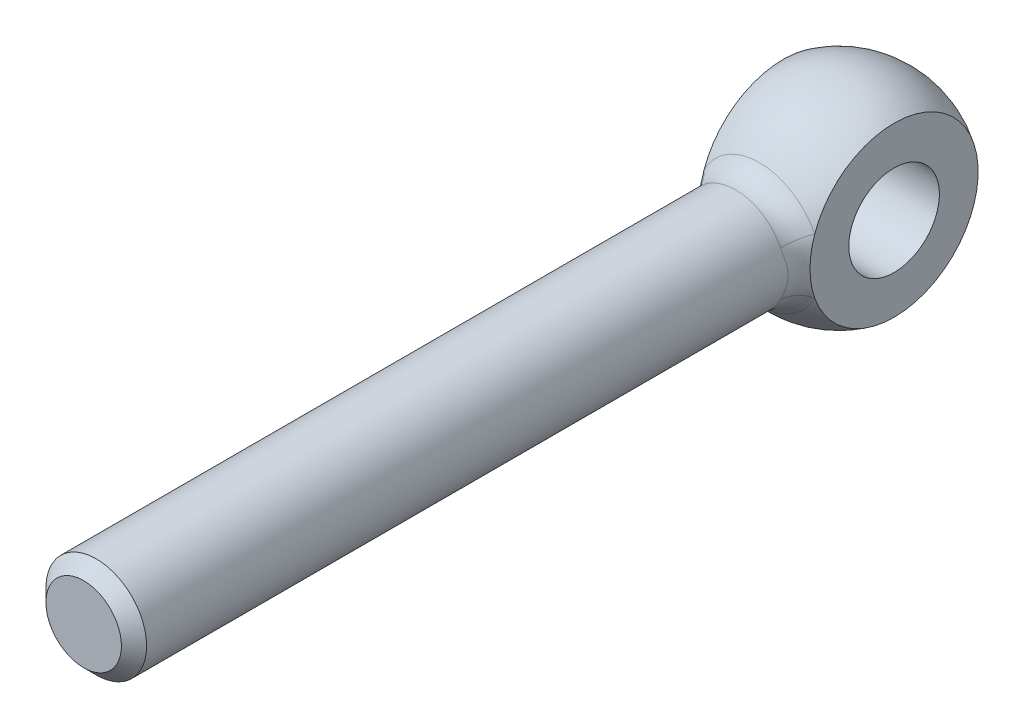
ISO-10303-21;
HEADER;
FILE_DESCRIPTION(('STEP AP214'),'2;1');
FILE_NAME('part.step','',(''),(''),'','','');
FILE_SCHEMA(('AUTOMOTIVE_DESIGN { 1 0 10303 214 1 1 1 1 }'));
ENDSEC;
DATA;
#1=APPLICATION_CONTEXT('core data for automotive mechanical design processes');
#2=APPLICATION_PROTOCOL_DEFINITION('international standard','automotive_design',2000,#1);
#3=PRODUCT_CONTEXT('',#1,'mechanical');
#4=PRODUCT('Part','Part','',(#3));
#5=PRODUCT_RELATED_PRODUCT_CATEGORY('part','',(#4));
#6=PRODUCT_DEFINITION_FORMATION('','',#4);
#7=PRODUCT_DEFINITION_CONTEXT('part definition',#1,'design');
#8=PRODUCT_DEFINITION('design','',#6,#7);
#9=PRODUCT_DEFINITION_SHAPE('','',#8);
#10=(LENGTH_UNIT() NAMED_UNIT(*) SI_UNIT(.MILLI.,.METRE.));
#11=(NAMED_UNIT(*) PLANE_ANGLE_UNIT() SI_UNIT($,.RADIAN.));
#12=(NAMED_UNIT(*) SI_UNIT($,.STERADIAN.) SOLID_ANGLE_UNIT());
#13=UNCERTAINTY_MEASURE_WITH_UNIT(LENGTH_MEASURE(1.E-05),#10,'distance_accuracy_value','');
#14=(GEOMETRIC_REPRESENTATION_CONTEXT(3) GLOBAL_UNCERTAINTY_ASSIGNED_CONTEXT((#13)) GLOBAL_UNIT_ASSIGNED_CONTEXT((#10,
#11,#12)) REPRESENTATION_CONTEXT('',''));
#15=CARTESIAN_POINT('',(0.,0.,0.));
#16=DIRECTION('',(0.,0.,1.));
#17=DIRECTION('',(1.,0.,0.));
#18=AXIS2_PLACEMENT_3D('',#15,#16,#17);
#19=CARTESIAN_POINT('',(0.,0.,0.));
#20=DIRECTION('',(-1.,0.,0.));
#21=DIRECTION('',(0.,0.,-1.));
#22=AXIS2_PLACEMENT_3D('',#19,#20,#21);
#23=SPHERICAL_SURFACE('',#22,20.);
#24=CARTESIAN_POINT('',(11.,0.,0.));
#25=DIRECTION('',(1.,0.,0.));
#26=DIRECTION('',(0.,0.,1.));
#27=AXIS2_PLACEMENT_3D('',#24,#25,#26);
#28=CIRCLE('',#27,16.70329308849);
#29=CARTESIAN_POINT('',(11.,5.52080518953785,15.7645396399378));
#30=VERTEX_POINT('',#29);
#31=CARTESIAN_POINT('',(11.,-5.52080518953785,15.7645396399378));
#32=VERTEX_POINT('',#31);
#33=EDGE_CURVE('E249',#30,#32,#28,.F.);
#34=ORIENTED_EDGE('',*,*,#33,.T.);
#35=CARTESIAN_POINT('',(0.,0.,15.7645396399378));
#36=DIRECTION('',(0.,0.,-1.));
#37=DIRECTION('',(-1.,0.,0.));
#38=AXIS2_PLACEMENT_3D('',#35,#36,#37);
#39=CIRCLE('',#38,12.3076923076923);
#40=CARTESIAN_POINT('',(-11.,-5.52080518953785,15.7645396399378));
#41=VERTEX_POINT('',#40);
#42=EDGE_CURVE('E72',#32,#41,#39,.T.);
#43=ORIENTED_EDGE('',*,*,#42,.T.);
#44=CARTESIAN_POINT('',(-11.,0.,0.));
#45=DIRECTION('',(1.,0.,0.));
#46=DIRECTION('',(0.,0.,1.));
#47=AXIS2_PLACEMENT_3D('',#44,#45,#46);
#48=CIRCLE('',#47,16.70329308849);
#49=CARTESIAN_POINT('',(-11.,5.52080518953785,15.7645396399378));
#50=VERTEX_POINT('',#49);
#51=EDGE_CURVE('E60',#50,#41,#48,.F.);
#52=ORIENTED_EDGE('',*,*,#51,.F.);
#53=CARTESIAN_POINT('',(0.,0.,15.7645396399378));
#54=DIRECTION('',(0.,0.,-1.));
#55=DIRECTION('',(-1.,0.,0.));
#56=AXIS2_PLACEMENT_3D('',#53,#54,#55);
#57=CIRCLE('',#56,12.3076923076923);
#58=EDGE_CURVE('E69',#50,#30,#57,.T.);
#59=ORIENTED_EDGE('',*,*,#58,.T.);
#60=EDGE_LOOP('',(#34,#43,#52,#59));
#61=FACE_BOUND('',#60,.T.);
#62=ADVANCED_FACE('F14',(#61),#23,.T.);
#63=CARTESIAN_POINT('',(0.,0.,-10.));
#64=DIRECTION('',(0.,0.,-1.));
#65=DIRECTION('',(1.,0.,0.));
#66=AXIS2_PLACEMENT_3D('',#63,#64,#65);
#67=CYLINDRICAL_SURFACE('',#66,10.);
#68=CARTESIAN_POINT('',(11.,8.07832617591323,14.6198716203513));
#69=CARTESIAN_POINT('',(8.08765754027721,5.99719772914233,16.1346741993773));
#70=CARTESIAN_POINT('',(7.28375150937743,6.85178545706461,19.8401938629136));
#71=CARTESIAN_POINT('',(11.,7.94371142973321,14.6942392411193));
#72=CARTESIAN_POINT('',(8.11920288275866,5.93544807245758,16.2397825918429));
#73=CARTESIAN_POINT('',(7.39683409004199,6.73162150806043,19.9238227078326));
#74=CARTESIAN_POINT('',(11.,7.80678494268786,14.7674864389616));
#75=CARTESIAN_POINT('',(8.15519367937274,5.8698319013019,16.3423149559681));
#76=CARTESIAN_POINT('',(7.50807818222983,6.60735770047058,19.9985173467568));
#77=CARTESIAN_POINT('',(11.,7.52777859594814,14.9116503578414));
#78=CARTESIAN_POINT('',(8.23492168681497,5.72986071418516,16.5404699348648));
#79=CARTESIAN_POINT('',(7.72578328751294,6.35140245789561,20.1309394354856));
#80=CARTESIAN_POINT('',(11.,7.38570047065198,14.9825678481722));
#81=CARTESIAN_POINT('',(8.27858235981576,5.65560014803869,16.6361171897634));
#82=CARTESIAN_POINT('',(7.83224588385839,6.21971351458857,20.1886725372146));
#83=CARTESIAN_POINT('',(11.,7.09641260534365,15.1217242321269));
#84=CARTESIAN_POINT('',(8.37244720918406,5.4973859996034,16.8193360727));
#85=CARTESIAN_POINT('',(8.03890108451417,5.95019585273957,20.2879075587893));
#86=CARTESIAN_POINT('',(11.,6.94922832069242,15.1899735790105));
#87=CARTESIAN_POINT('',(8.42255486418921,5.41357855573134,16.9069775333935));
#88=CARTESIAN_POINT('',(8.1391193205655,5.81239684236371,20.3294800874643));
#89=CARTESIAN_POINT('',(11.,6.64863682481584,15.3239259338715));
#90=CARTESIAN_POINT('',(8.52797993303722,5.23504745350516,17.0738797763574));
#91=CARTESIAN_POINT('',(8.33295854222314,5.53091179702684,20.3979224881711));
#92=CARTESIAN_POINT('',(11.,6.49523086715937,15.3896294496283));
#93=CARTESIAN_POINT('',(8.58324700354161,5.14042645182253,17.1531990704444));
#94=CARTESIAN_POINT('',(8.42658084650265,5.38722694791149,20.4247953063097));
#95=CARTESIAN_POINT('',(11.,6.20709411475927,15.5078088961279));
#96=CARTESIAN_POINT('',(8.68811994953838,4.95575537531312,17.2908288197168));
#97=CARTESIAN_POINT('',(8.59200338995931,5.11841729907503,20.4619167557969));
#98=CARTESIAN_POINT('',(11.,6.07336532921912,15.5607030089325));
#99=CARTESIAN_POINT('',(8.73711538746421,4.86761224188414,17.3504312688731));
#100=CARTESIAN_POINT('',(8.66488139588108,4.99405789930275,20.4741536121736));
#101=CARTESIAN_POINT('',(11.,5.80091130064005,15.6643118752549));
#102=CARTESIAN_POINT('',(8.83647568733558,4.68301353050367,17.4631108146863));
#103=CARTESIAN_POINT('',(8.80526889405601,4.74215537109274,20.4901477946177));
#104=CARTESIAN_POINT('',(11.,5.66218619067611,15.7150266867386));
#105=CARTESIAN_POINT('',(8.88683503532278,4.58660687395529,17.5162358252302));
#106=CARTESIAN_POINT('',(8.87277852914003,4.61461232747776,20.4939053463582));
#107=CARTESIAN_POINT('',(11.,5.2744874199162,15.8508024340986));
#108=CARTESIAN_POINT('',(9.02498244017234,4.31134076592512,17.6524759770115));
#109=CARTESIAN_POINT('',(9.05025948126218,4.26097993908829,20.4938948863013));
#110=CARTESIAN_POINT('',(11.,5.02010807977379,15.933417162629));
#111=CARTESIAN_POINT('',(9.1134168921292,4.12339116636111,17.7293699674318));
#112=CARTESIAN_POINT('',(9.15455589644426,4.03201043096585,20.482471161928));
#113=CARTESIAN_POINT('',(11.,4.49398867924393,16.0897301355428));
#114=CARTESIAN_POINT('',(9.2852606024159,3.7225223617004,17.8631716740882));
#115=CARTESIAN_POINT('',(9.3454636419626,3.56728408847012,20.4426249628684));
#116=CARTESIAN_POINT('',(11.,4.22223625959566,16.1634219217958));
#117=CARTESIAN_POINT('',(9.36879764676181,3.50966167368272,17.9203351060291));
#118=CARTESIAN_POINT('',(9.43206219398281,3.33152248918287,20.4141902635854));
#119=CARTESIAN_POINT('',(11.,3.65988605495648,16.2999751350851));
#120=CARTESIAN_POINT('',(9.52556401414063,3.06031940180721,18.0164117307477));
#121=CARTESIAN_POINT('',(9.58737307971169,2.8540318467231,20.3472388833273));
#122=CARTESIAN_POINT('',(11.,3.36923757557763,16.3628056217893));
#123=CARTESIAN_POINT('',(9.59896836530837,2.82367795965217,18.055508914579));
#124=CARTESIAN_POINT('',(9.65603459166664,2.61228792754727,20.3086941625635));
#125=CARTESIAN_POINT('',(11.,2.76973253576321,16.47487160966));
#126=CARTESIAN_POINT('',(9.7303273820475,2.33005694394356,18.1181298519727));
#127=CARTESIAN_POINT('',(9.77497001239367,2.12438390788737,20.2300406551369));
#128=CARTESIAN_POINT('',(11.,2.46087520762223,16.5241065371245));
#129=CARTESIAN_POINT('',(9.78851479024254,2.07279105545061,18.1418261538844));
#130=CARTESIAN_POINT('',(9.82524314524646,1.87822362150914,20.1899318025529));
#131=CARTESIAN_POINT('',(11.,1.97558099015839,16.5869215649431));
#132=CARTESIAN_POINT('',(9.8627242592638,1.66606653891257,18.1691299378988));
#133=CARTESIAN_POINT('',(9.88798469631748,1.49853407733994,20.1346921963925));
#134=CARTESIAN_POINT('',(11.,1.80486836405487,16.6064011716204));
#135=CARTESIAN_POINT('',(9.88572783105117,1.52271728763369,18.1769526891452));
#136=CARTESIAN_POINT('',(9.90713175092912,1.36624599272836,20.1166604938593));
#137=CARTESIAN_POINT('',(11.,1.45962748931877,16.6402989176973));
#138=CARTESIAN_POINT('',(9.92572316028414,1.2323607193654,18.1898667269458));
#139=CARTESIAN_POINT('',(9.94012224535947,1.1008390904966,20.0843097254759));
#140=CARTESIAN_POINT('',(11.,1.28509972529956,16.6547176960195));
#141=CARTESIAN_POINT('',(9.94274289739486,1.08526382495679,18.194968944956));
#142=CARTESIAN_POINT('',(9.95396635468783,0.967720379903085,20.0699901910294));
#143=CARTESIAN_POINT('',(11.,0.933265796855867,16.6781317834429));
#144=CARTESIAN_POINT('',(9.97034914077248,0.788518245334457,18.2029399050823));
#145=CARTESIAN_POINT('',(9.97630347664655,0.70091512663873,20.0463030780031));
#146=CARTESIAN_POINT('',(11.,0.755960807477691,16.6871293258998));
#147=CARTESIAN_POINT('',(9.98095837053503,0.638767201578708,18.2058159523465));
#148=CARTESIAN_POINT('',(9.98479869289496,0.567228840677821,20.0369334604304));
#149=CARTESIAN_POINT('',(11.,0.399779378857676,16.6994587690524));
#150=CARTESIAN_POINT('',(9.99548246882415,0.337908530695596,18.20969285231));
#151=CARTESIAN_POINT('',(9.99641148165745,0.299512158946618,20.024007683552));
#152=CARTESIAN_POINT('',(11.,0.220902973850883,16.7027907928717));
#153=CARTESIAN_POINT('',(9.99940850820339,0.186688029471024,18.2106967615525));
#154=CARTESIAN_POINT('',(9.99952917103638,0.165481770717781,20.0204513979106));
#155=CARTESIAN_POINT('',(11.,-0.136946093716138,16.7036898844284));
#156=CARTESIAN_POINT('',(10.0004672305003,-0.115727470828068,18.2109707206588));
#157=CARTESIAN_POINT('',(10.0003719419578,-0.102589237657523,20.0194964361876));
#158=CARTESIAN_POINT('',(11.,-0.315918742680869,16.7012576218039));
#159=CARTESIAN_POINT('',(9.99760151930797,-0.26703906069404,18.2102411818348));
#160=CARTESIAN_POINT('',(9.9980976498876,-0.236629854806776,20.0220970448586));
#161=CARTESIAN_POINT('',(11.,-0.672512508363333,16.6907025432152));
#162=CARTESIAN_POINT('',(9.98516890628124,-0.568286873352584,18.2069499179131));
#163=CARTESIAN_POINT('',(9.98816894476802,-0.504415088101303,20.0332017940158));
#164=CARTESIAN_POINT('',(11.,-0.850133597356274,16.6825796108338));
#165=CARTESIAN_POINT('',(9.97559239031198,-0.718336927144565,18.2043856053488));
#166=CARTESIAN_POINT('',(9.98051442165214,-0.638159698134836,20.0417060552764));
#167=CARTESIAN_POINT('',(11.,-1.20278271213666,16.6608685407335));
#168=CARTESIAN_POINT('',(9.94999783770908,-1.01586252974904,18.1971047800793));
#169=CARTESIAN_POINT('',(9.95985376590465,-0.905121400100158,20.063826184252));
#170=CARTESIAN_POINT('',(11.,-1.37780963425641,16.6472781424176));
#171=CARTESIAN_POINT('',(9.93395835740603,-1.16344227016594,18.1923815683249));
#172=CARTESIAN_POINT('',(9.94684541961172,-1.03833825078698,20.0774441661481));
#173=CARTESIAN_POINT('',(11.,-1.72418294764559,16.6149773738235));
#174=CARTESIAN_POINT('',(9.89585032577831,-1.45491369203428,18.1803094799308));
#175=CARTESIAN_POINT('',(9.91552061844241,-1.3039715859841,20.1086007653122));
#176=CARTESIAN_POINT('',(11.,-1.89552887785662,16.5962663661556));
#177=CARTESIAN_POINT('',(9.87375477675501,-1.59889725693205,18.1729504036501));
#178=CARTESIAN_POINT('',(9.89720350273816,-1.43638796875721,20.1261398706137));
#179=CARTESIAN_POINT('',(11.,-2.37500909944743,16.5365375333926));
#180=CARTESIAN_POINT('',(9.80319058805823,-2.00106700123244,18.1475319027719));
#181=CARTESIAN_POINT('',(9.83780774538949,-1.81042123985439,20.1794292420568));
#182=CARTESIAN_POINT('',(11.,-2.6779072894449,16.4899385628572));
#183=CARTESIAN_POINT('',(9.74810406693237,-2.25372442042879,18.1256509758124));
#184=CARTESIAN_POINT('',(9.79049373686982,-2.0509057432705,20.2181580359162));
#185=CARTESIAN_POINT('',(11.,-3.26643445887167,16.3835279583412));
#186=CARTESIAN_POINT('',(9.62321822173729,-2.7394442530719,18.0677502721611));
#187=CARTESIAN_POINT('',(9.67835774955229,-2.52772088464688,20.2950790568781));
#188=CARTESIAN_POINT('',(11.,-3.55206644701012,16.3237186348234));
#189=CARTESIAN_POINT('',(9.55320446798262,-2.97279590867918,18.0315791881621));
#190=CARTESIAN_POINT('',(9.61353883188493,-2.7640522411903,20.333271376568));
#191=CARTESIAN_POINT('',(11.,-4.10520079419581,16.1934500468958));
#192=CARTESIAN_POINT('',(9.40307308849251,-3.41694854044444,17.9425152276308));
#193=CARTESIAN_POINT('',(9.46676566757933,-3.23111087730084,20.4009956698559));
#194=CARTESIAN_POINT('',(11.,-4.37275328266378,16.1230221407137));
#195=CARTESIAN_POINT('',(9.32279049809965,-3.6279239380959,17.8894603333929));
#196=CARTESIAN_POINT('',(9.38486161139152,-3.4618524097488,20.430552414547));
#197=CARTESIAN_POINT('',(11.,-4.89128593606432,15.9733573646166));
#198=CARTESIAN_POINT('',(9.15681833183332,-4.02651224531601,17.7649594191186));
#199=CARTESIAN_POINT('',(9.20410009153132,-3.91720598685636,20.4744658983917));
#200=CARTESIAN_POINT('',(11.,-5.14226890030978,15.8941219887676));
#201=CARTESIAN_POINT('',(9.07099592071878,-4.21407941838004,17.6932699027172));
#202=CARTESIAN_POINT('',(9.10524550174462,-4.14181906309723,20.4888252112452));
#203=CARTESIAN_POINT('',(11.,-5.57948076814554,15.7452016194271));
#204=CARTESIAN_POINT('',(8.91675575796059,-4.52930004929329,17.5476124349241));
#205=CARTESIAN_POINT('',(8.91288683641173,-4.53858237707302,20.4959451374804));
#206=CARTESIAN_POINT('',(11.,-5.76853191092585,15.6768309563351));
#207=CARTESIAN_POINT('',(8.84816828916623,-4.66157604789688,17.4767712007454));
#208=CARTESIAN_POINT('',(8.82235160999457,-4.71214727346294,20.4924900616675));
#209=CARTESIAN_POINT('',(11.,-6.13738931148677,15.5361317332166));
#210=CARTESIAN_POINT('',(8.71360068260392,-4.91098552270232,17.3233243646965));
#211=CARTESIAN_POINT('',(8.63145758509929,-5.05332990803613,20.4699143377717));
#212=CARTESIAN_POINT('',(11.,-6.31719880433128,15.4638045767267));
#213=CARTESIAN_POINT('',(8.64763428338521,-5.02800230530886,17.2406040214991));
#214=CARTESIAN_POINT('',(8.53110226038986,-5.2209497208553,20.4507992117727));
#215=CARTESIAN_POINT('',(11.,-6.67039350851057,15.3147992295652));
#216=CARTESIAN_POINT('',(8.52017906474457,-5.24885941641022,17.062956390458));
#217=CARTESIAN_POINT('',(8.32005997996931,-5.55115938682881,20.3943977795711));
#218=CARTESIAN_POINT('',(11.,-6.84367796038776,15.2380797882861));
#219=CARTESIAN_POINT('',(8.45881409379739,-5.35236860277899,16.967804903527));
#220=CARTESIAN_POINT('',(8.20926514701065,-5.71366661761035,20.3568998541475));
#221=CARTESIAN_POINT('',(11.,-7.18254092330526,15.0813064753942));
#222=CARTESIAN_POINT('',(8.34361214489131,-5.54600465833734,16.7669351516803));
#223=CARTESIAN_POINT('',(7.97938823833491,-6.03058739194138,20.2617246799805));
#224=CARTESIAN_POINT('',(11.,-7.34810983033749,15.0012486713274));
#225=CARTESIAN_POINT('',(8.28987110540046,-5.63596246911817,16.6611306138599));
#226=CARTESIAN_POINT('',(7.86029627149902,-6.18499087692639,20.2040230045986));
#227=CARTESIAN_POINT('',(11.,-7.51010721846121,14.919728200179));
#228=CARTESIAN_POINT('',(8.24137694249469,-5.71943183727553,16.5511784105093));
#229=CARTESIAN_POINT('',(7.73770382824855,-6.3346617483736,20.1353038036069));
#230=(BOUNDED_SURFACE() B_SPLINE_SURFACE(3,2,((#68,#69,#70),(#71,#72,#73),(#74,#75,#76),(#77,
#78,#79),(#80,#81,#82),(#83,#84,#85),(#86,#87,#88),(#89,#90,#91),(#92,#93,#94),(#95,#96,#97),
(#98,#99,#100),(#101,#102,#103),(#104,#105,#106),(#107,#108,#109),(#110,#111,#112),(#113,#114,
#115),(#116,#117,#118),(#119,#120,#121),(#122,#123,#124),(#125,#126,#127),(#128,#129,#130),
(#131,#132,#133),(#134,#135,#136),(#137,#138,#139),(#140,#141,#142),(#143,#144,#145),(#146,#147,
#148),(#149,#150,#151),(#152,#153,#154),(#155,#156,#157),(#158,#159,#160),(#161,#162,#163),
(#164,#165,#166),(#167,#168,#169),(#170,#171,#172),(#173,#174,#175),(#176,#177,#178),(#179,#180,
#181),(#182,#183,#184),(#185,#186,#187),(#188,#189,#190),(#191,#192,#193),(#194,#195,#196),
(#197,#198,#199),(#200,#201,#202),(#203,#204,#205),(#206,#207,#208),(#209,#210,#211),(#212,#213,
#214),(#215,#216,#217),(#218,#219,#220),(#221,#222,#223),(#224,#225,#226),(#227,#228,#229)),
.UNSPECIFIED.,.F.,.F.,.F.) B_SPLINE_SURFACE_WITH_KNOTS((4,2,2,2,2,2,2,2,2,2,2,2,2,2,2,2,2,2,2,2,
2,2,2,2,2,2,4),(3,3),(0.,0.830487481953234,1.66069791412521,2.48723908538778,3.31361454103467,
4.00607990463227,4.69852683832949,5.90492644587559,7.11219405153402,8.32284604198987,
9.53354911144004,10.1772580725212,10.8208857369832,11.4642480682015,12.1075964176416,
12.7508700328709,13.3941568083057,14.0377098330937,14.6813430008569,15.8623569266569,
17.043164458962,18.2205508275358,19.3977377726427,20.336589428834,21.2751101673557,
22.224698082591,23.1754380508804),(0.,1.),
.UNSPECIFIED.) GEOMETRIC_REPRESENTATION_ITEM() RATIONAL_B_SPLINE_SURFACE(((1.,0.839284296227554,
1.),(1.,0.842507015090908,1.),(1.,0.845813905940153,1.),(1.,0.852563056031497,1.),(1.,
0.85600526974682,1.),(1.,0.862978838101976,1.),(1.,0.86650973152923,1.),(1.,0.873627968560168,
1.),(1.,0.877215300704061,1.),(1.,0.883811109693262,1.),(1.,0.886819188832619,1.),(1.,
0.892802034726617,1.),(1.,0.895776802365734,1.),(1.,0.903839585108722,1.),(1.,0.908857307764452,
1.),(1.,0.918479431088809,1.),(1.,0.923083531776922,1.),(1.,0.931678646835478,1.),(1.,
0.935667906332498,1.),(1.,0.942805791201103,1.),(1.,0.94595438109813,1.),(1.,0.949974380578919,
1.),(1.,0.95122168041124,1.),(1.,0.953392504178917,1.),(1.,0.954316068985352,1.),(1.,
0.955815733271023,1.),(1.,0.956391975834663,1.),(1.,0.957181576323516,1.),(1.,0.957394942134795,
1.),(1.,0.957452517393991,1.),(1.,0.957296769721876,1.),(1.,0.956620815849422,1.),(1.,
0.95610060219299,1.),(1.,0.954710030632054,1.),(1.,0.953839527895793,1.),(1.,0.951770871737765,
1.),(1.,0.950572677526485,1.),(1.,0.946749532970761,1.),(1.,0.943768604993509,1.),(1.,
0.936985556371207,1.),(1.,0.933183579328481,1.),(1.,0.924966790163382,1.),(1.,0.920553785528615,
1.),(1.,0.911300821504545,1.),(1.,0.906460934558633,1.),(1.,0.897549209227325,1.),(1.,
0.893520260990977,1.),(1.,0.885405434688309,1.),(1.,0.881319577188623,1.),(1.,0.873128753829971,
1.),(1.,0.869024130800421,1.),(1.,0.860913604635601,1.),(1.,0.856907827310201,1.),(1.,
0.852991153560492,1.))) REPRESENTATION_ITEM('') SURFACE());
#231=CARTESIAN_POINT('',(7.73770382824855,-6.3346617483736,20.1353038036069));
#232=CARTESIAN_POINT('',(7.86029627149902,-6.18499087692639,20.2040230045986));
#233=CARTESIAN_POINT('',(7.97938823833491,-6.03058739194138,20.2617246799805));
#234=CARTESIAN_POINT('',(8.20926514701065,-5.71366661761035,20.3568998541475));
#235=CARTESIAN_POINT('',(8.32005997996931,-5.55115938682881,20.3943977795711));
#236=CARTESIAN_POINT('',(8.53110226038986,-5.2209497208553,20.4507992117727));
#237=CARTESIAN_POINT('',(8.63145758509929,-5.05332990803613,20.4699143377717));
#238=CARTESIAN_POINT('',(8.82235160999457,-4.71214727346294,20.4924900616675));
#239=CARTESIAN_POINT('',(8.91288683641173,-4.53858237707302,20.4959451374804));
#240=CARTESIAN_POINT('',(9.10524550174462,-4.14181906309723,20.4888252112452));
#241=CARTESIAN_POINT('',(9.20410009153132,-3.91720598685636,20.4744658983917));
#242=CARTESIAN_POINT('',(9.38486161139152,-3.4618524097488,20.430552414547));
#243=CARTESIAN_POINT('',(9.46676566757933,-3.23111087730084,20.4009956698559));
#244=CARTESIAN_POINT('',(9.61353883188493,-2.7640522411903,20.333271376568));
#245=CARTESIAN_POINT('',(9.67835774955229,-2.52772088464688,20.2950790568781));
#246=CARTESIAN_POINT('',(9.79049373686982,-2.0509057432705,20.2181580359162));
#247=CARTESIAN_POINT('',(9.83780774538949,-1.81042123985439,20.1794292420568));
#248=CARTESIAN_POINT('',(9.89720350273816,-1.43638796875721,20.1261398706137));
#249=CARTESIAN_POINT('',(9.91552061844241,-1.3039715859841,20.1086007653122));
#250=CARTESIAN_POINT('',(9.94684541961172,-1.03833825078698,20.0774441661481));
#251=CARTESIAN_POINT('',(9.95985376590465,-0.905121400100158,20.063826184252));
#252=CARTESIAN_POINT('',(9.98051442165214,-0.638159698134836,20.0417060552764));
#253=CARTESIAN_POINT('',(9.98816894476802,-0.504415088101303,20.0332017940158));
#254=CARTESIAN_POINT('',(9.9980976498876,-0.236629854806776,20.0220970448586));
#255=CARTESIAN_POINT('',(10.0003719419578,-0.102589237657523,20.0194964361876));
#256=CARTESIAN_POINT('',(9.99952917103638,0.165481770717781,20.0204513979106));
#257=CARTESIAN_POINT('',(9.99641148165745,0.299512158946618,20.024007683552));
#258=CARTESIAN_POINT('',(9.98479869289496,0.567228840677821,20.0369334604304));
#259=CARTESIAN_POINT('',(9.97630347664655,0.70091512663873,20.0463030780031));
#260=CARTESIAN_POINT('',(9.95396635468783,0.967720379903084,20.0699901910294));
#261=CARTESIAN_POINT('',(9.94012224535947,1.1008390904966,20.0843097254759));
#262=CARTESIAN_POINT('',(9.90713175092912,1.36624599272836,20.1166604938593));
#263=CARTESIAN_POINT('',(9.88798469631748,1.49853407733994,20.1346921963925));
#264=CARTESIAN_POINT('',(9.82524314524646,1.87822362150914,20.1899318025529));
#265=CARTESIAN_POINT('',(9.77497001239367,2.12438390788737,20.2300406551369));
#266=CARTESIAN_POINT('',(9.65603459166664,2.61228792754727,20.3086941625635));
#267=CARTESIAN_POINT('',(9.58737307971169,2.8540318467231,20.3472388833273));
#268=CARTESIAN_POINT('',(9.43206219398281,3.33152248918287,20.4141902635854));
#269=CARTESIAN_POINT('',(9.3454636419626,3.56728408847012,20.4426249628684));
#270=CARTESIAN_POINT('',(9.15455589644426,4.03201043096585,20.482471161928));
#271=CARTESIAN_POINT('',(9.05025948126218,4.26097993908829,20.4938948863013));
#272=CARTESIAN_POINT('',(8.87277852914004,4.61461232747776,20.4939053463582));
#273=CARTESIAN_POINT('',(8.80526889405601,4.74215537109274,20.4901477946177));
#274=CARTESIAN_POINT('',(8.66488139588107,4.99405789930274,20.4741536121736));
#275=CARTESIAN_POINT('',(8.59200338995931,5.11841729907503,20.4619167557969));
#276=CARTESIAN_POINT('',(8.42658084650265,5.38722694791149,20.4247953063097));
#277=CARTESIAN_POINT('',(8.33295854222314,5.53091179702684,20.3979224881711));
#278=CARTESIAN_POINT('',(8.1391193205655,5.81239684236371,20.3294800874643));
#279=CARTESIAN_POINT('',(8.03890108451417,5.95019585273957,20.2879075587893));
#280=CARTESIAN_POINT('',(7.83224588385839,6.21971351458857,20.1886725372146));
#281=CARTESIAN_POINT('',(7.72578328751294,6.35140245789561,20.1309394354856));
#282=CARTESIAN_POINT('',(7.50807818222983,6.60735770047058,19.9985173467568));
#283=CARTESIAN_POINT('',(7.39683409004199,6.73162150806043,19.9238227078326));
#284=CARTESIAN_POINT('',(7.28375150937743,6.85178545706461,19.8401938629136));
#285=B_SPLINE_CURVE_WITH_KNOTS('',3,(#231,#232,#233,#234,#235,#236,#237,#238,#239,#240,#241,
#242,#243,#244,#245,#246,#247,#248,#249,#250,#251,#252,#253,#254,#255,#256,#257,#258,#259,#260,
#261,#262,#263,#264,#265,#266,#267,#268,#269,#270,#271,#272,#273,#274,#275,#276,#277,#278,#279,
#280,#281,#282,#283,#284),.UNSPECIFIED.,.F.,.F.,(4,2,2,2,2,2,2,2,2,2,2,2,2,2,2,2,2,2,2,2,2,2,2,
2,2,2,4),(0.,0.950739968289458,1.90032788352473,2.8388486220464,3.77770027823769,
4.95488722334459,6.13227359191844,7.31308112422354,8.49409505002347,9.13772821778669,
9.7812812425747,10.4245680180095,11.0678416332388,11.711189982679,12.3545523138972,
12.9981799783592,13.6418889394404,14.8525920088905,16.0632439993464,17.2705116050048,
18.4769112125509,19.1693581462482,19.8618235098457,20.6881989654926,21.5147401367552,
22.3449505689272,23.1754380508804),.UNSPECIFIED.);
#286=CARTESIAN_POINT('',(8.9375,-4.4856542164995,20.4939015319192));
#287=VERTEX_POINT('',#286);
#288=CARTESIAN_POINT('',(8.9375,4.48565421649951,20.4939015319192));
#289=VERTEX_POINT('',#288);
#290=EDGE_CURVE('E85',#287,#289,#285,.T.);
#291=ORIENTED_EDGE('',*,*,#290,.T.);
#292=CARTESIAN_POINT('',(0.,0.,20.4939015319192));
#293=DIRECTION('',(0.,0.,-1.));
#294=DIRECTION('',(-1.,0.,0.));
#295=AXIS2_PLACEMENT_3D('',#292,#293,#294);
#296=CIRCLE('',#295,10.);
#297=CARTESIAN_POINT('',(-8.9375,4.4856542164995,20.4939015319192));
#298=VERTEX_POINT('',#297);
#299=EDGE_CURVE('E9',#289,#298,#296,.F.);
#300=ORIENTED_EDGE('',*,*,#299,.T.);
#301=CARTESIAN_POINT('',(-11.,-8.07832621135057,14.6198716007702));
#302=CARTESIAN_POINT('',(-8.08765753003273,-5.9971977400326,16.1346741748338));
#303=CARTESIAN_POINT('',(-7.28375150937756,-6.85178545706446,19.8401938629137));
#304=CARTESIAN_POINT('',(-11.,-7.94371144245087,14.6942392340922));
#305=CARTESIAN_POINT('',(-8.11920287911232,-5.93544807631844,16.2397825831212));
#306=CARTESIAN_POINT('',(-7.39683409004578,-6.73162150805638,19.9238227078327));
#307=CARTESIAN_POINT('',(-11.,-7.80678494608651,14.7674864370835));
#308=CARTESIAN_POINT('',(-8.15519367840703,-5.86983190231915,16.3423149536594));
#309=CARTESIAN_POINT('',(-7.50807818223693,-6.60735770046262,19.9985173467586));
#310=CARTESIAN_POINT('',(-11.,-7.52777859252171,14.9116503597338));
#311=CARTESIAN_POINT('',(-8.23492168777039,-5.72986071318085,16.5404699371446));
#312=CARTESIAN_POINT('',(-7.72578328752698,-6.35140245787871,20.1309394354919));
#313=CARTESIAN_POINT('',(-11.,-7.38570046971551,14.9825678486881));
#314=CARTESIAN_POINT('',(-8.27858236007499,-5.65560014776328,16.6361171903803));
#315=CARTESIAN_POINT('',(-7.83224588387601,-6.21971351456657,20.1886725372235));
#316=CARTESIAN_POINT('',(-11.,-7.09641260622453,15.121724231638));
#317=CARTESIAN_POINT('',(-8.37244720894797,-5.49738599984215,16.8193360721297));
#318=CARTESIAN_POINT('',(-8.03890108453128,-5.9501958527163,20.2879075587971));
#319=CARTESIAN_POINT('',(-11.,-6.94922832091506,15.1899735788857));
#320=CARTESIAN_POINT('',(-8.42255486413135,-5.41357855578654,16.9069775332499));
#321=CARTESIAN_POINT('',(-8.13911932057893,-5.81239684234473,20.3294800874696));
#322=CARTESIAN_POINT('',(-11.,-6.6486368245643,15.3239259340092));
#323=CARTESIAN_POINT('',(-8.52797993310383,-5.23504745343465,17.0738797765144));
#324=CARTESIAN_POINT('',(-8.33295854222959,-5.53091179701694,20.3979224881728));
#325=CARTESIAN_POINT('',(-11.,-6.49523086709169,15.3896294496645));
#326=CARTESIAN_POINT('',(-8.58324700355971,-5.14042645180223,17.1531990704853));
#327=CARTESIAN_POINT('',(-8.42658084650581,-5.38722694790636,20.4247953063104));
#328=CARTESIAN_POINT('',(-11.,-6.20709411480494,15.5078088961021));
#329=CARTESIAN_POINT('',(-8.68811994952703,-4.95575537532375,17.290828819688));
#330=CARTESIAN_POINT('',(-8.5920033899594,-5.11841729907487,20.4619167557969));
#331=CARTESIAN_POINT('',(-11.,-6.0733653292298,15.5607030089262));
#332=CARTESIAN_POINT('',(-8.73711538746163,-4.86761224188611,17.350431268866));
#333=CARTESIAN_POINT('',(-8.66488139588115,-4.99405789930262,20.4741536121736));
#334=CARTESIAN_POINT('',(-11.,-5.80091130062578,15.6643118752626));
#335=CARTESIAN_POINT('',(-8.83647568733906,-4.68301353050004,17.4631108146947));
#336=CARTESIAN_POINT('',(-8.80526889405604,-4.74215537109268,20.4901477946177));
#337=CARTESIAN_POINT('',(-11.,-5.66218619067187,15.7150266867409));
#338=CARTESIAN_POINT('',(-8.8868350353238,-4.58660687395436,17.5162358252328));
#339=CARTESIAN_POINT('',(-8.87277852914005,-4.61461232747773,20.4939053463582));
#340=CARTESIAN_POINT('',(-11.,-5.27448741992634,15.8508024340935));
#341=CARTESIAN_POINT('',(-9.02498244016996,-4.31134076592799,17.6524759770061));
#342=CARTESIAN_POINT('',(-9.05025948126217,-4.26097993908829,20.4938948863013));
#343=CARTESIAN_POINT('',(-11.,-5.02010807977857,15.933417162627));
#344=CARTESIAN_POINT('',(-9.11341689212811,-4.12339116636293,17.7293699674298));
#345=CARTESIAN_POINT('',(-9.15455589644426,-4.03201043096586,20.482471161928));
#346=CARTESIAN_POINT('',(-11.,-4.49398867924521,16.089730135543));
#347=CARTESIAN_POINT('',(-9.28526060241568,-3.72252236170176,17.8631716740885));
#348=CARTESIAN_POINT('',(-9.3454636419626,-3.56728408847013,20.4426249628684));
#349=CARTESIAN_POINT('',(-11.,-4.22223625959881,16.1634219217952));
#350=CARTESIAN_POINT('',(-9.36879764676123,-3.50966167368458,17.9203351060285));
#351=CARTESIAN_POINT('',(-9.43206219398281,-3.33152248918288,20.4141902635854));
#352=CARTESIAN_POINT('',(-11.,-3.65988605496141,16.2999751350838));
#353=CARTESIAN_POINT('',(-9.52556401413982,-3.06031940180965,18.0164117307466));
#354=CARTESIAN_POINT('',(-9.58737307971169,-2.85403184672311,20.3472388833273));
#355=CARTESIAN_POINT('',(-11.,-3.36923757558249,16.3628056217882));
#356=CARTESIAN_POINT('',(-9.59896836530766,-2.82367795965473,18.0555089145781));
#357=CARTESIAN_POINT('',(-9.65603459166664,-2.61228792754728,20.3086941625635));
#358=CARTESIAN_POINT('',(-11.,-2.76973253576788,16.4748716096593));
#359=CARTESIAN_POINT('',(-9.73032738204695,-2.33005694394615,18.1181298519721));
#360=CARTESIAN_POINT('',(-9.77497001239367,-2.12438390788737,20.2300406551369));
#361=CARTESIAN_POINT('',(-11.,-2.46087520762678,16.5241065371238));
#362=CARTESIAN_POINT('',(-9.78851479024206,-2.07279105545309,18.1418261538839));
#363=CARTESIAN_POINT('',(-9.82524314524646,-1.87822362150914,20.1899318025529));
#364=CARTESIAN_POINT('',(-11.,-1.97558099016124,16.5869215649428));
#365=CARTESIAN_POINT('',(-9.86272425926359,-1.66606653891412,18.1691299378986));
#366=CARTESIAN_POINT('',(-9.88798469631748,-1.49853407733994,20.1346921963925));
#367=CARTESIAN_POINT('',(-11.,-1.80486836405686,16.6064011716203));
#368=CARTESIAN_POINT('',(-9.88572783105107,-1.52271728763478,18.176952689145));
#369=CARTESIAN_POINT('',(-9.90713175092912,-1.36624599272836,20.1166604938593));
#370=CARTESIAN_POINT('',(-11.,-1.45962748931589,16.6402989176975));
#371=CARTESIAN_POINT('',(-9.9257231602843,-1.23236071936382,18.189866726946));
#372=CARTESIAN_POINT('',(-9.94012224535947,-1.10083909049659,20.0843097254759));
#373=CARTESIAN_POINT('',(-11.,-1.28509972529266,16.6547176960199));
#374=CARTESIAN_POINT('',(-9.94274289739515,-1.08526382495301,18.1949689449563));
#375=CARTESIAN_POINT('',(-9.95396635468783,-0.967720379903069,20.0699901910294));
#376=CARTESIAN_POINT('',(-11.,-0.933265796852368,16.6781317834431));
#377=CARTESIAN_POINT('',(-9.97034914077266,-0.788518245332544,18.2029399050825));
#378=CARTESIAN_POINT('',(-9.97630347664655,-0.700915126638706,20.0463030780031));
#379=CARTESIAN_POINT('',(-11.,-0.755960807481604,16.6871293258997));
#380=CARTESIAN_POINT('',(-9.98095837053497,-0.638767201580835,18.2058159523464));
#381=CARTESIAN_POINT('',(-9.98479869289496,-0.567228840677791,20.0369334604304));
#382=CARTESIAN_POINT('',(-11.,-0.399779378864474,16.6994587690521));
#383=CARTESIAN_POINT('',(-9.99548246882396,-0.337908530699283,18.2096928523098));
#384=CARTESIAN_POINT('',(-9.99641148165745,-0.29951215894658,20.024007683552));
#385=CARTESIAN_POINT('',(-11.,-0.220902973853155,16.7027907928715));
#386=CARTESIAN_POINT('',(-9.99940850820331,-0.186688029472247,18.2106967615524));
#387=CARTESIAN_POINT('',(-9.99952917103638,-0.165481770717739,20.0204513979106));
#388=CARTESIAN_POINT('',(-11.,0.136946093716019,16.7036898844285));
#389=CARTESIAN_POINT('',(-10.0004672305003,0.115727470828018,18.2109707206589));
#390=CARTESIAN_POINT('',(-10.0003719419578,0.102589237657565,20.0194964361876));
#391=CARTESIAN_POINT('',(-11.,0.315918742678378,16.701257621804));
#392=CARTESIAN_POINT('',(-9.99760151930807,0.267039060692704,18.2102411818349));
#393=CARTESIAN_POINT('',(-9.9980976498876,0.236629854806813,20.0220970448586));
#394=CARTESIAN_POINT('',(-11.,0.672512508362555,16.6907025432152));
#395=CARTESIAN_POINT('',(-9.98516890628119,0.568286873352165,18.206949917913));
#396=CARTESIAN_POINT('',(-9.98816894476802,0.504415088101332,20.0332017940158));
#397=CARTESIAN_POINT('',(-11.,0.850133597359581,16.6825796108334));
#398=CARTESIAN_POINT('',(-9.97559239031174,0.718336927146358,18.2043856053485));
#399=CARTESIAN_POINT('',(-9.98051442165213,0.638159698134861,20.0417060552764));
#400=CARTESIAN_POINT('',(-11.,1.20278271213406,16.6608685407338));
#401=CARTESIAN_POINT('',(-9.94999783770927,1.01586252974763,18.1971047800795));
#402=CARTESIAN_POINT('',(-9.95985376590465,0.905121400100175,20.063826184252));
#403=CARTESIAN_POINT('',(-11.,1.3778096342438,16.6472781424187));
#404=CARTESIAN_POINT('',(-9.93395835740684,1.16344227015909,18.1923815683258));
#405=CARTESIAN_POINT('',(-9.94684541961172,1.03833825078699,20.0774441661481));
#406=CARTESIAN_POINT('',(-11.,1.72418294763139,16.6149773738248));
#407=CARTESIAN_POINT('',(-9.89585032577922,1.45491369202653,18.1803094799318));
#408=CARTESIAN_POINT('',(-9.91552061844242,1.3039715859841,20.1086007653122));
#409=CARTESIAN_POINT('',(-11.,1.89552887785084,16.5962663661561));
#410=CARTESIAN_POINT('',(-9.87375477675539,1.59889725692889,18.1729504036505));
#411=CARTESIAN_POINT('',(-9.89720350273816,1.43638796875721,20.1261398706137));
#412=CARTESIAN_POINT('',(-11.,2.37500909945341,16.5365375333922));
#413=CARTESIAN_POINT('',(-9.80319058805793,2.00106700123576,18.1475319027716));
#414=CARTESIAN_POINT('',(-9.83780774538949,1.81042123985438,20.1794292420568));
#415=CARTESIAN_POINT('',(-11.,2.67790728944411,16.4899385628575));
#416=CARTESIAN_POINT('',(-9.74810406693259,2.25372442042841,18.1256509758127));
#417=CARTESIAN_POINT('',(-9.79049373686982,2.05090574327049,20.2181580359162));
#418=CARTESIAN_POINT('',(-11.,3.26643445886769,16.3835279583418));
#419=CARTESIAN_POINT('',(-9.62321822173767,2.73944425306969,18.0677502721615));
#420=CARTESIAN_POINT('',(-9.67835774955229,2.52772088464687,20.2950790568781));
#421=CARTESIAN_POINT('',(-11.,3.55206644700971,16.3237186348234));
#422=CARTESIAN_POINT('',(-9.55320446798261,2.97279590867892,18.031579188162));
#423=CARTESIAN_POINT('',(-9.61353883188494,2.76405224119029,20.333271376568));
#424=CARTESIAN_POINT('',(-11.,4.10520079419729,16.1934500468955));
#425=CARTESIAN_POINT('',(-9.40307308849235,3.41694854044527,17.9425152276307));
#426=CARTESIAN_POINT('',(-9.46676566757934,3.23111087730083,20.4009956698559));
#427=CARTESIAN_POINT('',(-11.,4.37275328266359,16.1230221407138));
#428=CARTESIAN_POINT('',(-9.32279049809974,3.62792393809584,17.889460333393));
#429=CARTESIAN_POINT('',(-9.38486161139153,3.46185240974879,20.430552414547));
#430=CARTESIAN_POINT('',(-11.,4.89128593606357,15.9733573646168));
#431=CARTESIAN_POINT('',(-9.15681833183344,4.02651224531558,17.7649594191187));
#432=CARTESIAN_POINT('',(-9.20410009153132,3.91720598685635,20.4744658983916));
#433=CARTESIAN_POINT('',(-11.,5.14226890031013,15.8941219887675));
#434=CARTESIAN_POINT('',(-9.07099592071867,4.21407941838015,17.693269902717));
#435=CARTESIAN_POINT('',(-9.10524550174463,4.14181906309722,20.4888252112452));
#436=CARTESIAN_POINT('',(-11.,5.57948076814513,15.7452016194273));
#437=CARTESIAN_POINT('',(-8.91675575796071,4.52930004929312,17.5476124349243));
#438=CARTESIAN_POINT('',(-8.91288683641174,4.53858237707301,20.4959451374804));
#439=CARTESIAN_POINT('',(-11.,5.76853191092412,15.6768309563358));
#440=CARTESIAN_POINT('',(-8.8481682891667,4.66157604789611,17.4767712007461));
#441=CARTESIAN_POINT('',(-8.82235160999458,4.71214727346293,20.4924900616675));
#442=CARTESIAN_POINT('',(-11.,6.13738931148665,15.5361317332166));
#443=CARTESIAN_POINT('',(-8.71360068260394,4.91098552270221,17.3233243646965));
#444=CARTESIAN_POINT('',(-8.6314575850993,5.05332990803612,20.4699143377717));
#445=CARTESIAN_POINT('',(-11.,6.31719880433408,15.4638045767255));
#446=CARTESIAN_POINT('',(-8.64763428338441,5.02800230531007,17.2406040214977));
#447=CARTESIAN_POINT('',(-8.53110226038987,5.22094972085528,20.4507992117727));
#448=CARTESIAN_POINT('',(-11.,6.67039350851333,15.3147992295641));
#449=CARTESIAN_POINT('',(-8.52017906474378,5.24885941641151,17.0629563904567));
#450=CARTESIAN_POINT('',(-8.32005997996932,5.5511593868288,20.3943977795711));
#451=CARTESIAN_POINT('',(-11.,6.84367796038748,15.2380797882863));
#452=CARTESIAN_POINT('',(-8.45881409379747,5.35236860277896,16.9678049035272));
#453=CARTESIAN_POINT('',(-8.20926514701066,5.71366661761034,20.3568998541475));
#454=CARTESIAN_POINT('',(-11.,7.18254092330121,15.0813064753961));
#455=CARTESIAN_POINT('',(-8.34361214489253,5.54600465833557,16.7669351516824));
#456=CARTESIAN_POINT('',(-7.97938823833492,6.03058739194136,20.2617246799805));
#457=CARTESIAN_POINT('',(-11.,7.34810983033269,15.0012486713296));
#458=CARTESIAN_POINT('',(-8.28987110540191,5.63596246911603,16.6611306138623));
#459=CARTESIAN_POINT('',(-7.86029627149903,6.18499087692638,20.2040230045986));
#460=CARTESIAN_POINT('',(-11.,7.510107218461,14.9197282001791));
#461=CARTESIAN_POINT('',(-8.24137694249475,5.71943183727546,16.5511784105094));
#462=CARTESIAN_POINT('',(-7.73770382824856,6.33466174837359,20.1353038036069));
#463=(BOUNDED_SURFACE() B_SPLINE_SURFACE(3,2,((#301,#302,#303),(#304,#305,#306),(#307,#308,
#309),(#310,#311,#312),(#313,#314,#315),(#316,#317,#318),(#319,#320,#321),(#322,#323,#324),
(#325,#326,#327),(#328,#329,#330),(#331,#332,#333),(#334,#335,#336),(#337,#338,#339),(#340,#341,
#342),(#343,#344,#345),(#346,#347,#348),(#349,#350,#351),(#352,#353,#354),(#355,#356,#357),
(#358,#359,#360),(#361,#362,#363),(#364,#365,#366),(#367,#368,#369),(#370,#371,#372),(#373,#374,
#375),(#376,#377,#378),(#379,#380,#381),(#382,#383,#384),(#385,#386,#387),(#388,#389,#390),
(#391,#392,#393),(#394,#395,#396),(#397,#398,#399),(#400,#401,#402),(#403,#404,#405),(#406,#407,
#408),(#409,#410,#411),(#412,#413,#414),(#415,#416,#417),(#418,#419,#420),(#421,#422,#423),
(#424,#425,#426),(#427,#428,#429),(#430,#431,#432),(#433,#434,#435),(#436,#437,#438),(#439,#440,
#441),(#442,#443,#444),(#445,#446,#447),(#448,#449,#450),(#451,#452,#453),(#454,#455,#456),
(#457,#458,#459),(#460,#461,#462)),.UNSPECIFIED.,.F.,.F.,.F.) B_SPLINE_SURFACE_WITH_KNOTS((4,2,
2,2,2,2,2,2,2,2,2,2,2,2,2,2,2,2,2,2,2,2,2,2,2,2,4),(3,3),(0.,0.830487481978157,1.66069791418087,
2.48723908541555,3.31361454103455,4.00607990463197,4.69852683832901,5.9049264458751,
7.11219405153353,8.32284604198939,9.53354911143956,10.1772580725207,10.8208857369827,
11.464248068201,12.1075964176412,12.7508700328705,13.3941568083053,14.0377098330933,
14.6813430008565,15.8623569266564,17.0431644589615,18.2205508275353,19.3977377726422,
20.3365894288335,21.2751101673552,22.2246980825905,23.1754380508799),(0.,1.),
.UNSPECIFIED.) GEOMETRIC_REPRESENTATION_ITEM() RATIONAL_B_SPLINE_SURFACE(((1.,0.839284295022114,
1.),(1.,0.842507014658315,1.),(1.,0.845813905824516,1.),(1.,0.852563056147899,1.),(1.,
0.85600526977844,1.),(1.,0.862978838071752,1.),(1.,0.866509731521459,1.),(1.,0.873627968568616,
1.),(1.,0.87721530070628,1.),(1.,0.88381110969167,1.),(1.,0.886819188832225,1.),(1.,
0.892802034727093,1.),(1.,0.895776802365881,1.),(1.,0.903839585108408,1.),(1.,0.908857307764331,
1.),(1.,0.918479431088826,1.),(1.,0.923083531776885,1.),(1.,0.931678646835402,1.),(1.,
0.935667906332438,1.),(1.,0.942805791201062,1.),(1.,0.945954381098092,1.),(1.,0.949974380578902,
1.),(1.,0.951221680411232,1.),(1.,0.95339250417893,1.),(1.,0.954316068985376,1.),(1.,
0.955815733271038,1.),(1.,0.956391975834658,1.),(1.,0.957181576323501,1.),(1.,0.957394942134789,
1.),(1.,0.957452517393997,1.),(1.,0.957296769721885,1.),(1.,0.956620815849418,1.),(1.,
0.956100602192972,1.),(1.,0.95471003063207,1.),(1.,0.953839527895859,1.),(1.,0.951770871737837,
1.),(1.,0.950572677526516,1.),(1.,0.946749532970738,1.),(1.,0.943768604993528,1.),(1.,
0.936985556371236,1.),(1.,0.933183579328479,1.),(1.,0.92496679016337,1.),(1.,0.920553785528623,
1.),(1.,0.911300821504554,1.),(1.,0.906460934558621,1.),(1.,0.897549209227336,1.),(1.,
0.89352026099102,1.),(1.,0.885405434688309,1.),(1.,0.881319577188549,1.),(1.,0.873128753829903,
1.),(1.,0.869024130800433,1.),(1.,0.860913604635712,1.),(1.,0.85690782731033,1.),(1.,
0.852991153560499,1.))) REPRESENTATION_ITEM('') SURFACE());
#464=CARTESIAN_POINT('',(-7.73770382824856,6.33466174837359,20.1353038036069));
#465=CARTESIAN_POINT('',(-7.86029627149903,6.18499087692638,20.2040230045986));
#466=CARTESIAN_POINT('',(-7.97938823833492,6.03058739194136,20.2617246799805));
#467=CARTESIAN_POINT('',(-8.20926514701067,5.71366661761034,20.3568998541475));
#468=CARTESIAN_POINT('',(-8.32005997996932,5.5511593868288,20.3943977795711));
#469=CARTESIAN_POINT('',(-8.53110226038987,5.22094972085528,20.4507992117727));
#470=CARTESIAN_POINT('',(-8.6314575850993,5.05332990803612,20.4699143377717));
#471=CARTESIAN_POINT('',(-8.82235160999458,4.71214727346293,20.4924900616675));
#472=CARTESIAN_POINT('',(-8.91288683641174,4.53858237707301,20.4959451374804));
#473=CARTESIAN_POINT('',(-9.10524550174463,4.14181906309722,20.4888252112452));
#474=CARTESIAN_POINT('',(-9.20410009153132,3.91720598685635,20.4744658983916));
#475=CARTESIAN_POINT('',(-9.38486161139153,3.46185240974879,20.430552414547));
#476=CARTESIAN_POINT('',(-9.46676566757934,3.23111087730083,20.4009956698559));
#477=CARTESIAN_POINT('',(-9.61353883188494,2.76405224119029,20.333271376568));
#478=CARTESIAN_POINT('',(-9.67835774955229,2.52772088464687,20.2950790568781));
#479=CARTESIAN_POINT('',(-9.79049373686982,2.0509057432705,20.2181580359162));
#480=CARTESIAN_POINT('',(-9.83780774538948,1.81042123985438,20.1794292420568));
#481=CARTESIAN_POINT('',(-9.89720350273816,1.43638796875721,20.1261398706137));
#482=CARTESIAN_POINT('',(-9.91552061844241,1.3039715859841,20.1086007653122));
#483=CARTESIAN_POINT('',(-9.94684541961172,1.03833825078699,20.0774441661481));
#484=CARTESIAN_POINT('',(-9.95985376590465,0.905121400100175,20.063826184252));
#485=CARTESIAN_POINT('',(-9.98051442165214,0.63815969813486,20.0417060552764));
#486=CARTESIAN_POINT('',(-9.98816894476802,0.504415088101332,20.0332017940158));
#487=CARTESIAN_POINT('',(-9.9980976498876,0.236629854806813,20.0220970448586));
#488=CARTESIAN_POINT('',(-10.0003719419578,0.102589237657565,20.0194964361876));
#489=CARTESIAN_POINT('',(-9.99952917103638,-0.165481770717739,20.0204513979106));
#490=CARTESIAN_POINT('',(-9.99641148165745,-0.29951215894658,20.024007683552));
#491=CARTESIAN_POINT('',(-9.98479869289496,-0.567228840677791,20.0369334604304));
#492=CARTESIAN_POINT('',(-9.97630347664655,-0.700915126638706,20.0463030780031));
#493=CARTESIAN_POINT('',(-9.95396635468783,-0.967720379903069,20.0699901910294));
#494=CARTESIAN_POINT('',(-9.94012224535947,-1.10083909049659,20.0843097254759));
#495=CARTESIAN_POINT('',(-9.90713175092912,-1.36624599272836,20.1166604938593));
#496=CARTESIAN_POINT('',(-9.88798469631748,-1.49853407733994,20.1346921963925));
#497=CARTESIAN_POINT('',(-9.82524314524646,-1.87822362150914,20.1899318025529));
#498=CARTESIAN_POINT('',(-9.77497001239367,-2.12438390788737,20.2300406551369));
#499=CARTESIAN_POINT('',(-9.65603459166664,-2.61228792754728,20.3086941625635));
#500=CARTESIAN_POINT('',(-9.58737307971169,-2.85403184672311,20.3472388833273));
#501=CARTESIAN_POINT('',(-9.43206219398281,-3.33152248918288,20.4141902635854));
#502=CARTESIAN_POINT('',(-9.3454636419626,-3.56728408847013,20.4426249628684));
#503=CARTESIAN_POINT('',(-9.15455589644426,-4.03201043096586,20.482471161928));
#504=CARTESIAN_POINT('',(-9.05025948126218,-4.26097993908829,20.4938948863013));
#505=CARTESIAN_POINT('',(-8.87277852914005,-4.61461232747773,20.4939053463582));
#506=CARTESIAN_POINT('',(-8.80526889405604,-4.74215537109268,20.4901477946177));
#507=CARTESIAN_POINT('',(-8.66488139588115,-4.99405789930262,20.4741536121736));
#508=CARTESIAN_POINT('',(-8.5920033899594,-5.11841729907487,20.4619167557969));
#509=CARTESIAN_POINT('',(-8.42658084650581,-5.38722694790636,20.4247953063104));
#510=CARTESIAN_POINT('',(-8.33295854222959,-5.53091179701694,20.3979224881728));
#511=CARTESIAN_POINT('',(-8.13911932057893,-5.81239684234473,20.3294800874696));
#512=CARTESIAN_POINT('',(-8.03890108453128,-5.9501958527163,20.2879075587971));
#513=CARTESIAN_POINT('',(-7.83224588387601,-6.21971351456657,20.1886725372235));
#514=CARTESIAN_POINT('',(-7.72578328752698,-6.35140245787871,20.1309394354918));
#515=CARTESIAN_POINT('',(-7.50807818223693,-6.60735770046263,19.9985173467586));
#516=CARTESIAN_POINT('',(-7.39683409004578,-6.73162150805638,19.9238227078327));
#517=CARTESIAN_POINT('',(-7.28375150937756,-6.85178545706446,19.8401938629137));
#518=B_SPLINE_CURVE_WITH_KNOTS('',3,(#464,#465,#466,#467,#468,#469,#470,#471,#472,#473,#474,
#475,#476,#477,#478,#479,#480,#481,#482,#483,#484,#485,#486,#487,#488,#489,#490,#491,#492,#493,
#494,#495,#496,#497,#498,#499,#500,#501,#502,#503,#504,#505,#506,#507,#508,#509,#510,#511,#512,
#513,#514,#515,#516,#517),.UNSPECIFIED.,.F.,.F.,(4,2,2,2,2,2,2,2,2,2,2,2,2,2,2,2,2,2,2,2,2,2,2,
2,2,2,4),(0.,0.950739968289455,1.90032788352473,2.83884862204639,3.77770027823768,
4.95488722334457,6.13227359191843,7.31308112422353,8.49409505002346,9.13772821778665,
9.78128124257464,10.4245680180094,11.0678416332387,11.7111899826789,12.3545523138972,
12.9981799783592,13.6418889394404,14.8525920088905,16.0632439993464,17.2705116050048,
18.4769112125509,19.1693581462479,19.8618235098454,20.6881989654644,21.5147401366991,
22.3449505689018,23.1754380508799),.UNSPECIFIED.);
#519=CARTESIAN_POINT('',(-8.9375,-4.48565421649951,20.4939015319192));
#520=VERTEX_POINT('',#519);
#521=EDGE_CURVE('E27',#298,#520,#518,.T.);
#522=ORIENTED_EDGE('',*,*,#521,.T.);
#523=CARTESIAN_POINT('',(0.,0.,20.4939015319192));
#524=DIRECTION('',(0.,0.,-1.));
#525=DIRECTION('',(-1.,0.,0.));
#526=AXIS2_PLACEMENT_3D('',#523,#524,#525);
#527=CIRCLE('',#526,10.);
#528=EDGE_CURVE('E96',#520,#287,#527,.F.);
#529=ORIENTED_EDGE('',*,*,#528,.T.);
#530=EDGE_LOOP('',(#291,#300,#522,#529));
#531=FACE_BOUND('',#530,.T.);
#532=CARTESIAN_POINT('',(0.,0.,147.5));
#533=DIRECTION('',(0.,0.,-1.));
#534=DIRECTION('',(1.,0.,0.));
#535=AXIS2_PLACEMENT_3D('',#532,#533,#534);
#536=CIRCLE('',#535,10.);
#537=CARTESIAN_POINT('',(10.,0.,147.5));
#538=VERTEX_POINT('',#537);
#539=EDGE_CURVE('E252',#538,#538,#536,.T.);
#540=ORIENTED_EDGE('',*,*,#539,.T.);
#541=EDGE_LOOP('',(#540));
#542=FACE_BOUND('',#541,.T.);
#543=ADVANCED_FACE('F102',(#531,#542),#67,.T.);
#544=CARTESIAN_POINT('',(0.,0.,150.));
#545=DIRECTION('',(0.,0.,-1.));
#546=DIRECTION('',(1.,0.,0.));
#547=AXIS2_PLACEMENT_3D('',#544,#545,#546);
#548=CONICAL_SURFACE('',#547,7.5,0.785398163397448);
#549=ORIENTED_EDGE('',*,*,#539,.F.);
#550=EDGE_LOOP('',(#549));
#551=FACE_BOUND('',#550,.T.);
#552=CARTESIAN_POINT('',(0.,0.,150.));
#553=DIRECTION('',(0.,0.,-1.));
#554=DIRECTION('',(1.,0.,0.));
#555=AXIS2_PLACEMENT_3D('',#552,#553,#554);
#556=CIRCLE('',#555,7.5);
#557=CARTESIAN_POINT('',(7.5,0.,150.));
#558=VERTEX_POINT('',#557);
#559=EDGE_CURVE('E64',#558,#558,#556,.T.);
#560=ORIENTED_EDGE('',*,*,#559,.T.);
#561=EDGE_LOOP('',(#560));
#562=FACE_BOUND('',#561,.T.);
#563=ADVANCED_FACE('F107',(#551,#562),#548,.T.);
#564=CARTESIAN_POINT('',(0.,-7.5,150.));
#565=DIRECTION('',(0.,0.,1.));
#566=DIRECTION('',(-1.,0.,0.));
#567=AXIS2_PLACEMENT_3D('',#564,#565,#566);
#568=PLANE('',#567);
#569=ORIENTED_EDGE('',*,*,#559,.F.);
#570=EDGE_LOOP('',(#569));
#571=FACE_BOUND('',#570,.T.);
#572=ADVANCED_FACE('F167',(#571),#568,.T.);
#573=CARTESIAN_POINT('',(-11.,20.,-19.9999999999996));
#574=DIRECTION('',(1.,0.,0.));
#575=DIRECTION('',(0.,0.,1.));
#576=AXIS2_PLACEMENT_3D('',#573,#574,#575);
#577=PLANE('',#576);
#578=CARTESIAN_POINT('',(-11.,0.,0.));
#579=DIRECTION('',(1.,0.,0.));
#580=DIRECTION('',(0.,0.,1.));
#581=AXIS2_PLACEMENT_3D('',#578,#579,#580);
#582=CIRCLE('',#581,9.);
#583=CARTESIAN_POINT('',(-11.,0.,9.));
#584=VERTEX_POINT('',#583);
#585=EDGE_CURVE('E250',#584,#584,#582,.T.);
#586=ORIENTED_EDGE('',*,*,#585,.T.);
#587=EDGE_LOOP('',(#586));
#588=FACE_BOUND('',#587,.T.);
#589=ORIENTED_EDGE('',*,*,#51,.T.);
#590=EDGE_CURVE('E57',#41,#50,#48,.F.);
#591=ORIENTED_EDGE('',*,*,#590,.T.);
#592=EDGE_LOOP('',(#589,#591));
#593=FACE_BOUND('',#592,.T.);
#594=ADVANCED_FACE('F59',(#588,#593),#577,.F.);
#595=CARTESIAN_POINT('',(11.,20.,-19.9999999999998));
#596=DIRECTION('',(1.,0.,0.));
#597=DIRECTION('',(0.,0.,1.));
#598=AXIS2_PLACEMENT_3D('',#595,#596,#597);
#599=PLANE('',#598);
#600=CARTESIAN_POINT('',(11.,0.,0.));
#601=DIRECTION('',(1.,0.,0.));
#602=DIRECTION('',(0.,0.,1.));
#603=AXIS2_PLACEMENT_3D('',#600,#601,#602);
#604=CIRCLE('',#603,9.);
#605=CARTESIAN_POINT('',(11.,0.,9.));
#606=VERTEX_POINT('',#605);
#607=EDGE_CURVE('E77',#606,#606,#604,.T.);
#608=ORIENTED_EDGE('',*,*,#607,.F.);
#609=EDGE_LOOP('',(#608));
#610=FACE_BOUND('',#609,.T.);
#611=ORIENTED_EDGE('',*,*,#33,.F.);
#612=EDGE_CURVE('E245',#32,#30,#28,.F.);
#613=ORIENTED_EDGE('',*,*,#612,.F.);
#614=EDGE_LOOP('',(#611,#613));
#615=FACE_BOUND('',#614,.T.);
#616=ADVANCED_FACE('F109',(#610,#615),#599,.T.);
#617=CARTESIAN_POINT('',(15.,0.,0.));
#618=DIRECTION('',(-1.,0.,0.));
#619=DIRECTION('',(0.,0.,-1.));
#620=AXIS2_PLACEMENT_3D('',#617,#618,#619);
#621=CYLINDRICAL_SURFACE('',#620,9.);
#622=ORIENTED_EDGE('',*,*,#607,.T.);
#623=EDGE_LOOP('',(#622));
#624=FACE_BOUND('',#623,.T.);
#625=ORIENTED_EDGE('',*,*,#585,.F.);
#626=EDGE_LOOP('',(#625));
#627=FACE_BOUND('',#626,.T.);
#628=ADVANCED_FACE('F123',(#624,#627),#621,.F.);
#629=CARTESIAN_POINT('',(-14.3,-7.17704674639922,20.4939015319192));
#630=DIRECTION('',(0.448565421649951,-0.89375,0.));
#631=DIRECTION('',(0.89375,0.448565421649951,0.));
#632=AXIS2_PLACEMENT_3D('',#629,#630,#631);
#633=CIRCLE('',#632,6.);
#634=EDGE_CURVE('E78',#520,#41,#633,.F.);
#635=ORIENTED_EDGE('',*,*,#634,.F.);
#636=ORIENTED_EDGE('',*,*,#521,.F.);
#637=CARTESIAN_POINT('',(-14.3,7.1770467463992,20.4939015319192));
#638=DIRECTION('',(-0.44856542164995,-0.89375,0.));
#639=DIRECTION('',(0.89375,-0.44856542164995,0.));
#640=AXIS2_PLACEMENT_3D('',#637,#638,#639);
#641=CIRCLE('',#640,6.);
#642=EDGE_CURVE('E74',#50,#298,#641,.T.);
#643=ORIENTED_EDGE('',*,*,#642,.F.);
#644=ORIENTED_EDGE('',*,*,#590,.F.);
#645=EDGE_LOOP('',(#635,#636,#643,#644));
#646=FACE_BOUND('',#645,.T.);
#647=ADVANCED_FACE('F75',(#646),#463,.F.);
#648=CARTESIAN_POINT('',(0.,0.,20.4939015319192));
#649=DIRECTION('',(0.,0.,-1.));
#650=DIRECTION('',(-1.,0.,0.));
#651=AXIS2_PLACEMENT_3D('',#648,#649,#650);
#652=TOROIDAL_SURFACE('',#651,16.,6.);
#653=ORIENTED_EDGE('',*,*,#642,.T.);
#654=ORIENTED_EDGE('',*,*,#299,.F.);
#655=CARTESIAN_POINT('',(14.3,7.1770467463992,20.4939015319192));
#656=DIRECTION('',(-0.448565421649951,0.89375,0.));
#657=DIRECTION('',(-0.89375,-0.448565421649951,0.));
#658=AXIS2_PLACEMENT_3D('',#655,#656,#657);
#659=CIRCLE('',#658,6.);
#660=EDGE_CURVE('E82',#30,#289,#659,.T.);
#661=ORIENTED_EDGE('',*,*,#660,.F.);
#662=ORIENTED_EDGE('',*,*,#58,.F.);
#663=EDGE_LOOP('',(#653,#654,#661,#662));
#664=FACE_BOUND('',#663,.T.);
#665=ADVANCED_FACE('F81',(#664),#652,.F.);
#666=CARTESIAN_POINT('',(0.,0.,20.4939015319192));
#667=DIRECTION('',(0.,0.,-1.));
#668=DIRECTION('',(-1.,0.,0.));
#669=AXIS2_PLACEMENT_3D('',#666,#667,#668);
#670=TOROIDAL_SURFACE('',#669,16.,6.);
#671=ORIENTED_EDGE('',*,*,#634,.T.);
#672=ORIENTED_EDGE('',*,*,#42,.F.);
#673=CARTESIAN_POINT('',(14.3,-7.17704674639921,20.4939015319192));
#674=DIRECTION('',(-0.448565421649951,-0.89375,0.));
#675=DIRECTION('',(0.89375,-0.448565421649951,0.));
#676=AXIS2_PLACEMENT_3D('',#673,#674,#675);
#677=CIRCLE('',#676,6.);
#678=EDGE_CURVE('E133',#287,#32,#677,.T.);
#679=ORIENTED_EDGE('',*,*,#678,.F.);
#680=ORIENTED_EDGE('',*,*,#528,.F.);
#681=EDGE_LOOP('',(#671,#672,#679,#680));
#682=FACE_BOUND('',#681,.T.);
#683=ADVANCED_FACE('F209',(#682),#670,.F.);
#684=ORIENTED_EDGE('',*,*,#660,.T.);
#685=ORIENTED_EDGE('',*,*,#290,.F.);
#686=ORIENTED_EDGE('',*,*,#678,.T.);
#687=ORIENTED_EDGE('',*,*,#612,.T.);
#688=EDGE_LOOP('',(#684,#685,#686,#687));
#689=FACE_BOUND('',#688,.T.);
#690=ADVANCED_FACE('F113',(#689),#230,.F.);
#691=CLOSED_SHELL('',(#62,#543,#563,#572,#594,#616,#628,#647,#665,#683,#690));
#692=MANIFOLD_SOLID_BREP('B1',#691);
#693=ADVANCED_BREP_SHAPE_REPRESENTATION('',(#18,#692),#14);
#694=SHAPE_DEFINITION_REPRESENTATION(#9,#693);
ENDSEC;
END-ISO-10303-21;
